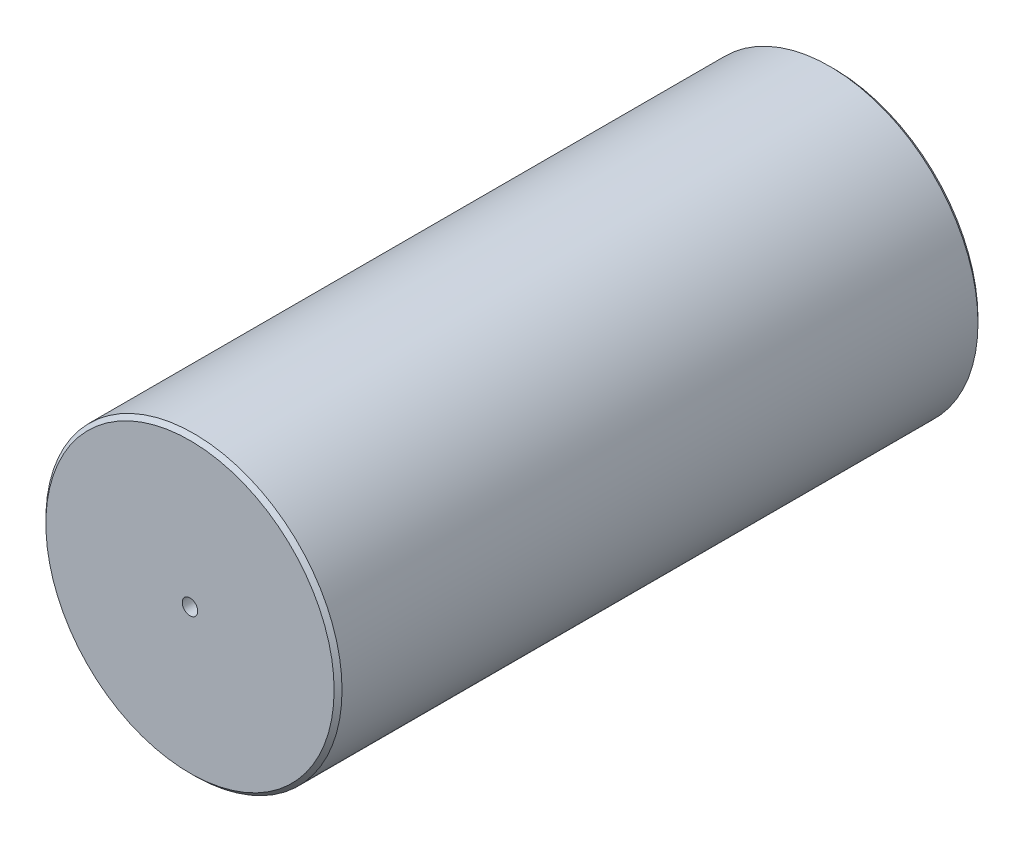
from build123d import *

# Parameters (mm, degrees)
SKETCH1_R                       = 18.9865
BOSS_EXTRUDE1_DEPTH             = 82.55
SKETCH2_R                       = 12.7
CUT_EXTRUDE1_DEPTH              = 38.1
F_5_64_0_07813_DIAMETER_HOLE1_D = 1.984502
CHAMFER1_SIZE                   = 0.508


with BuildPart() as part:
    # Sketch1 → Boss-Extrude1 (new body)
    with BuildSketch(Plane.XY):
        Circle(SKETCH1_R)
    extrude(amount=BOSS_EXTRUDE1_DEPTH)

    # Sketch2 → Cut-Extrude1 (cut)
    with BuildSketch(Plane(origin=(0, 0, 0), x_dir=(-1, 0, 0), z_dir=(0, 0, -1))):
        Circle(SKETCH2_R)
    extrude(amount=-CUT_EXTRUDE1_DEPTH, mode=Mode.SUBTRACT)

    # 5_64 _0.07813_ Diameter Hole1 (through all)
    with Locations(Plane.XY.offset(82.55)):
        with Locations((0, 0)):
            Hole(F_5_64_0_07813_DIAMETER_HOLE1_D / 2)

    # Chamfer1
    chamfer1_edges = [part.edges().sort_by_distance(p)[0] for p in [
        (-18.9865, 0, 0),
        (-18.9865, 0, 82.55),
    ]]
    chamfer(chamfer1_edges, length=CHAMFER1_SIZE)


solid = part.part
